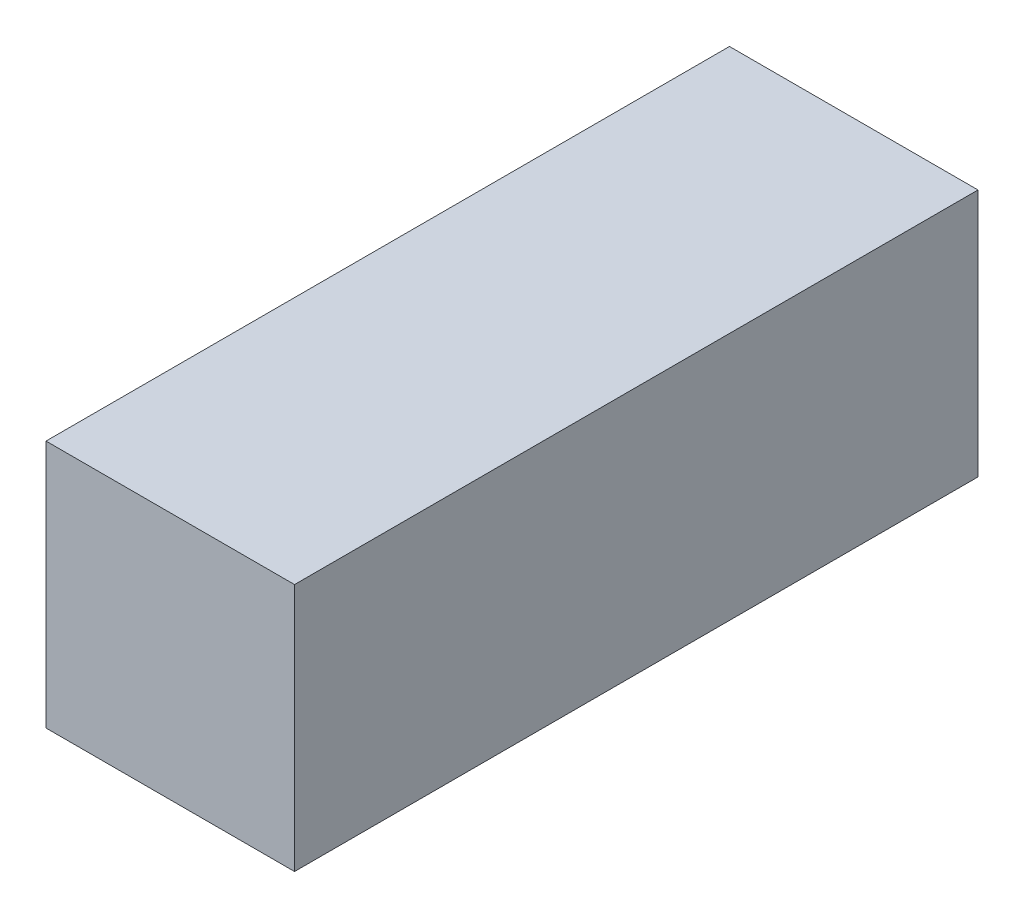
from build123d import *

# Parameters (mm, degrees)
AUFSATZ_LINEAR_AUSTRAGEN1_DEPTH      = 200
AUFSATZ_LINEAR_AUSTRAGEN1_DEPTH_BACK = 20
SKIZZE1_W                            = 80
SKIZZE1_H                            = 80


with BuildPart() as part:
    # Skizze1 → Aufsatz-Linear austragen1 (new, two sides: drawn at the far end of the back side and taken through both)
    with BuildSketch(Plane.XY.offset(-AUFSATZ_LINEAR_AUSTRAGEN1_DEPTH_BACK)):
        with Locations((64, -238)):
            Rectangle(SKIZZE1_W, SKIZZE1_H)
    extrude(amount=AUFSATZ_LINEAR_AUSTRAGEN1_DEPTH + AUFSATZ_LINEAR_AUSTRAGEN1_DEPTH_BACK)


solid = part.part
